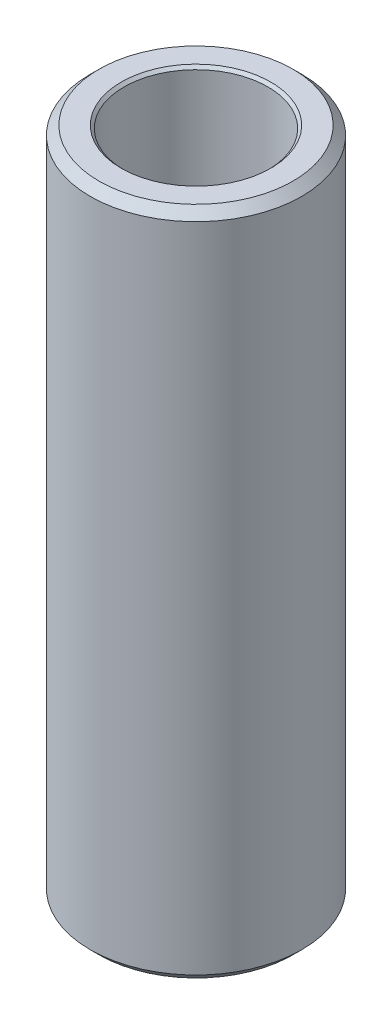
ISO-10303-21;
HEADER;
FILE_DESCRIPTION(('STEP AP214'),'2;1');
FILE_NAME('part.step','',(''),(''),'','','');
FILE_SCHEMA(('AUTOMOTIVE_DESIGN { 1 0 10303 214 1 1 1 1 }'));
ENDSEC;
DATA;
#1=APPLICATION_CONTEXT('core data for automotive mechanical design processes');
#2=APPLICATION_PROTOCOL_DEFINITION('international standard','automotive_design',2000,#1);
#3=PRODUCT_CONTEXT('',#1,'mechanical');
#4=PRODUCT('Part','Part','',(#3));
#5=PRODUCT_RELATED_PRODUCT_CATEGORY('part','',(#4));
#6=PRODUCT_DEFINITION_FORMATION('','',#4);
#7=PRODUCT_DEFINITION_CONTEXT('part definition',#1,'design');
#8=PRODUCT_DEFINITION('design','',#6,#7);
#9=PRODUCT_DEFINITION_SHAPE('','',#8);
#10=(LENGTH_UNIT() NAMED_UNIT(*) SI_UNIT(.MILLI.,.METRE.));
#11=(NAMED_UNIT(*) PLANE_ANGLE_UNIT() SI_UNIT($,.RADIAN.));
#12=(NAMED_UNIT(*) SI_UNIT($,.STERADIAN.) SOLID_ANGLE_UNIT());
#13=UNCERTAINTY_MEASURE_WITH_UNIT(LENGTH_MEASURE(1.E-05),#10,'distance_accuracy_value','');
#14=(GEOMETRIC_REPRESENTATION_CONTEXT(3) GLOBAL_UNCERTAINTY_ASSIGNED_CONTEXT((#13)) GLOBAL_UNIT_ASSIGNED_CONTEXT((#10,
#11,#12)) REPRESENTATION_CONTEXT('',''));
#15=CARTESIAN_POINT('',(0.,0.,0.));
#16=DIRECTION('',(0.,0.,1.));
#17=DIRECTION('',(1.,0.,0.));
#18=AXIS2_PLACEMENT_3D('',#15,#16,#17);
#19=CARTESIAN_POINT('',(0.,64.77,0.));
#20=DIRECTION('',(0.,1.,0.));
#21=DIRECTION('',(0.,0.,1.));
#22=AXIS2_PLACEMENT_3D('',#19,#20,#21);
#23=CYLINDRICAL_SURFACE('',#22,6.477);
#24=CARTESIAN_POINT('',(0.,0.254000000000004,0.));
#25=DIRECTION('',(0.,-1.,0.));
#26=DIRECTION('',(0.,0.,-1.));
#27=AXIS2_PLACEMENT_3D('',#24,#25,#26);
#28=CIRCLE('',#27,6.477);
#29=CARTESIAN_POINT('',(0.,0.254000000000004,-6.477));
#30=VERTEX_POINT('',#29);
#31=EDGE_CURVE('E37',#30,#30,#28,.T.);
#32=ORIENTED_EDGE('',*,*,#31,.T.);
#33=EDGE_LOOP('',(#32));
#34=FACE_BOUND('',#33,.T.);
#35=CARTESIAN_POINT('',(0.,60.071,0.));
#36=DIRECTION('',(0.,1.,0.));
#37=DIRECTION('',(0.,0.,1.));
#38=AXIS2_PLACEMENT_3D('',#35,#36,#37);
#39=CIRCLE('',#38,6.477);
#40=CARTESIAN_POINT('',(0.,60.071,6.477));
#41=VERTEX_POINT('',#40);
#42=EDGE_CURVE('E41',#41,#41,#39,.T.);
#43=ORIENTED_EDGE('',*,*,#42,.T.);
#44=EDGE_LOOP('',(#43));
#45=FACE_BOUND('',#44,.T.);
#46=ADVANCED_FACE('F30',(#34,#45),#23,.F.);
#47=CARTESIAN_POINT('',(9.52499999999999,0.,0.));
#48=DIRECTION('',(0.,-1.,0.));
#49=DIRECTION('',(0.,0.,-1.));
#50=AXIS2_PLACEMENT_3D('',#47,#48,#49);
#51=PLANE('',#50);
#52=CARTESIAN_POINT('',(0.,0.,0.));
#53=DIRECTION('',(0.,-1.,0.));
#54=DIRECTION('',(0.,0.,-1.));
#55=AXIS2_PLACEMENT_3D('',#52,#53,#54);
#56=CIRCLE('',#55,6.731);
#57=CARTESIAN_POINT('',(0.,0.,-6.731));
#58=VERTEX_POINT('',#57);
#59=EDGE_CURVE('E45',#58,#58,#56,.F.);
#60=ORIENTED_EDGE('',*,*,#59,.T.);
#61=EDGE_LOOP('',(#60));
#62=FACE_BOUND('',#61,.T.);
#63=CARTESIAN_POINT('',(0.,0.,0.));
#64=DIRECTION('',(0.,-1.,0.));
#65=DIRECTION('',(0.,0.,-1.));
#66=AXIS2_PLACEMENT_3D('',#63,#64,#65);
#67=CIRCLE('',#66,8.73124999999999);
#68=CARTESIAN_POINT('',(0.,0.,-8.73124999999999));
#69=VERTEX_POINT('',#68);
#70=EDGE_CURVE('E50',#69,#69,#67,.T.);
#71=ORIENTED_EDGE('',*,*,#70,.T.);
#72=EDGE_LOOP('',(#71));
#73=FACE_BOUND('',#72,.T.);
#74=ADVANCED_FACE('F82',(#62,#73),#51,.T.);
#75=CARTESIAN_POINT('',(0.,64.77,0.));
#76=DIRECTION('',(0.,1.,0.));
#77=DIRECTION('',(0.,0.,1.));
#78=AXIS2_PLACEMENT_3D('',#75,#76,#77);
#79=CYLINDRICAL_SURFACE('',#78,9.52499999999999);
#80=CARTESIAN_POINT('',(0.,59.53125,0.));
#81=DIRECTION('',(0.,1.,0.));
#82=DIRECTION('',(0.,0.,1.));
#83=AXIS2_PLACEMENT_3D('',#80,#81,#82);
#84=CIRCLE('',#83,9.52499999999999);
#85=CARTESIAN_POINT('',(0.,59.53125,9.52499999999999));
#86=VERTEX_POINT('',#85);
#87=EDGE_CURVE('E53',#86,#86,#84,.F.);
#88=ORIENTED_EDGE('',*,*,#87,.T.);
#89=EDGE_LOOP('',(#88));
#90=FACE_BOUND('',#89,.T.);
#91=CARTESIAN_POINT('',(0.,0.79375000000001,0.));
#92=DIRECTION('',(0.,-1.,0.));
#93=DIRECTION('',(0.,0.,-1.));
#94=AXIS2_PLACEMENT_3D('',#91,#92,#93);
#95=CIRCLE('',#94,9.52499999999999);
#96=CARTESIAN_POINT('',(0.,0.79375000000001,-9.52499999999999));
#97=VERTEX_POINT('',#96);
#98=EDGE_CURVE('E56',#97,#97,#95,.F.);
#99=ORIENTED_EDGE('',*,*,#98,.T.);
#100=EDGE_LOOP('',(#99));
#101=FACE_BOUND('',#100,.T.);
#102=ADVANCED_FACE('F77',(#90,#101),#79,.T.);
#103=CARTESIAN_POINT('',(6.477,60.325,0.));
#104=DIRECTION('',(0.,1.,0.));
#105=DIRECTION('',(0.,0.,1.));
#106=AXIS2_PLACEMENT_3D('',#103,#104,#105);
#107=PLANE('',#106);
#108=CARTESIAN_POINT('',(0.,60.325,0.));
#109=DIRECTION('',(0.,1.,0.));
#110=DIRECTION('',(0.,0.,1.));
#111=AXIS2_PLACEMENT_3D('',#108,#109,#110);
#112=CIRCLE('',#111,6.731);
#113=CARTESIAN_POINT('',(0.,60.325,6.731));
#114=VERTEX_POINT('',#113);
#115=EDGE_CURVE('E10',#114,#114,#112,.F.);
#116=ORIENTED_EDGE('',*,*,#115,.T.);
#117=EDGE_LOOP('',(#116));
#118=FACE_BOUND('',#117,.T.);
#119=CARTESIAN_POINT('',(0.,60.325,0.));
#120=DIRECTION('',(0.,1.,0.));
#121=DIRECTION('',(0.,0.,1.));
#122=AXIS2_PLACEMENT_3D('',#119,#120,#121);
#123=CIRCLE('',#122,8.73124999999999);
#124=CARTESIAN_POINT('',(0.,60.325,8.73124999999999));
#125=VERTEX_POINT('',#124);
#126=EDGE_CURVE('E59',#125,#125,#123,.T.);
#127=ORIENTED_EDGE('',*,*,#126,.T.);
#128=EDGE_LOOP('',(#127));
#129=FACE_BOUND('',#128,.T.);
#130=ADVANCED_FACE('F63',(#118,#129),#107,.T.);
#131=CARTESIAN_POINT('',(0.,60.325,0.));
#132=DIRECTION('',(0.,-1.,0.));
#133=DIRECTION('',(0.,0.,-1.));
#134=AXIS2_PLACEMENT_3D('',#131,#132,#133);
#135=CONICAL_SURFACE('',#134,8.73124999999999,0.785398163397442);
#136=ORIENTED_EDGE('',*,*,#87,.F.);
#137=EDGE_LOOP('',(#136));
#138=FACE_BOUND('',#137,.T.);
#139=ORIENTED_EDGE('',*,*,#126,.F.);
#140=EDGE_LOOP('',(#139));
#141=FACE_BOUND('',#140,.T.);
#142=ADVANCED_FACE('F65',(#138,#141),#135,.T.);
#143=CARTESIAN_POINT('',(0.,0.79375000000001,0.));
#144=DIRECTION('',(0.,1.,0.));
#145=DIRECTION('',(0.,0.,1.));
#146=AXIS2_PLACEMENT_3D('',#143,#144,#145);
#147=CONICAL_SURFACE('',#146,9.52499999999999,0.785398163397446);
#148=ORIENTED_EDGE('',*,*,#70,.F.);
#149=EDGE_LOOP('',(#148));
#150=FACE_BOUND('',#149,.T.);
#151=ORIENTED_EDGE('',*,*,#98,.F.);
#152=EDGE_LOOP('',(#151));
#153=FACE_BOUND('',#152,.T.);
#154=ADVANCED_FACE('F67',(#150,#153),#147,.T.);
#155=CARTESIAN_POINT('',(0.,0.,0.));
#156=DIRECTION('',(0.,-1.,0.));
#157=DIRECTION('',(0.,0.,-1.));
#158=AXIS2_PLACEMENT_3D('',#155,#156,#157);
#159=CONICAL_SURFACE('',#158,6.731,0.785398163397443);
#160=ORIENTED_EDGE('',*,*,#31,.F.);
#161=EDGE_LOOP('',(#160));
#162=FACE_BOUND('',#161,.T.);
#163=ORIENTED_EDGE('',*,*,#59,.F.);
#164=EDGE_LOOP('',(#163));
#165=FACE_BOUND('',#164,.T.);
#166=ADVANCED_FACE('F74',(#162,#165),#159,.F.);
#167=CARTESIAN_POINT('',(0.,60.071,0.));
#168=DIRECTION('',(0.,1.,0.));
#169=DIRECTION('',(0.,0.,1.));
#170=AXIS2_PLACEMENT_3D('',#167,#168,#169);
#171=CONICAL_SURFACE('',#170,6.477,0.785398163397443);
#172=ORIENTED_EDGE('',*,*,#115,.F.);
#173=EDGE_LOOP('',(#172));
#174=FACE_BOUND('',#173,.T.);
#175=ORIENTED_EDGE('',*,*,#42,.F.);
#176=EDGE_LOOP('',(#175));
#177=FACE_BOUND('',#176,.T.);
#178=ADVANCED_FACE('F32',(#174,#177),#171,.F.);
#179=CLOSED_SHELL('',(#46,#74,#102,#130,#142,#154,#166,#178));
#180=MANIFOLD_SOLID_BREP('B2',#179);
#181=ADVANCED_BREP_SHAPE_REPRESENTATION('',(#18,#180),#14);
#182=SHAPE_DEFINITION_REPRESENTATION(#9,#181);
ENDSEC;
END-ISO-10303-21;
